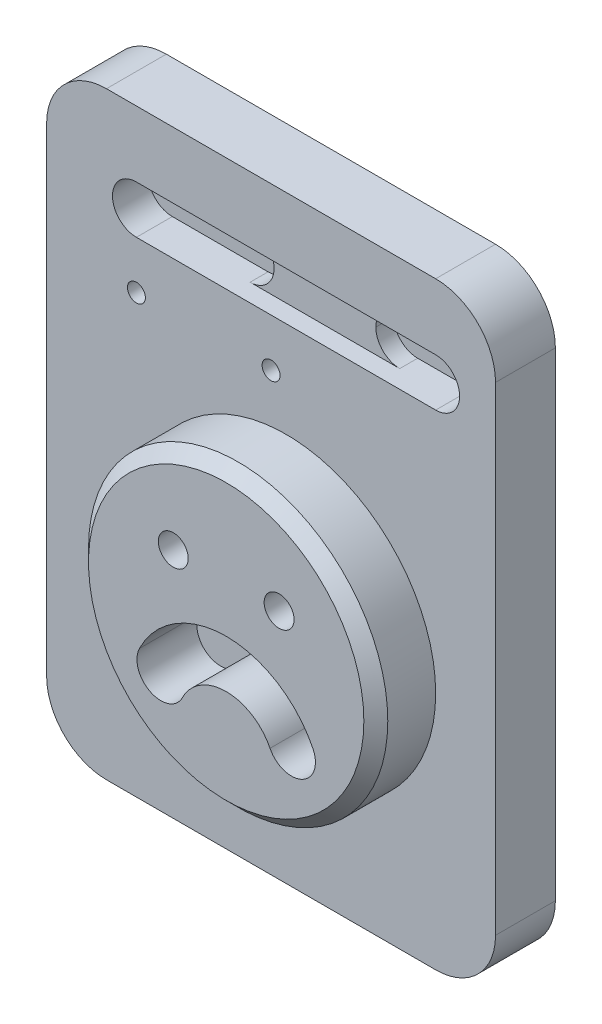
ISO-10303-21;
HEADER;
FILE_DESCRIPTION(('STEP AP214'),'2;1');
FILE_NAME('part.step','',(''),(''),'','','');
FILE_SCHEMA(('AUTOMOTIVE_DESIGN { 1 0 10303 214 1 1 1 1 }'));
ENDSEC;
DATA;
#1=APPLICATION_CONTEXT('core data for automotive mechanical design processes');
#2=APPLICATION_PROTOCOL_DEFINITION('international standard','automotive_design',2000,#1);
#3=PRODUCT_CONTEXT('',#1,'mechanical');
#4=PRODUCT('Part','Part','',(#3));
#5=PRODUCT_RELATED_PRODUCT_CATEGORY('part','',(#4));
#6=PRODUCT_DEFINITION_FORMATION('','',#4);
#7=PRODUCT_DEFINITION_CONTEXT('part definition',#1,'design');
#8=PRODUCT_DEFINITION('design','',#6,#7);
#9=PRODUCT_DEFINITION_SHAPE('','',#8);
#10=(LENGTH_UNIT() NAMED_UNIT(*) SI_UNIT(.MILLI.,.METRE.));
#11=(NAMED_UNIT(*) PLANE_ANGLE_UNIT() SI_UNIT($,.RADIAN.));
#12=(NAMED_UNIT(*) SI_UNIT($,.STERADIAN.) SOLID_ANGLE_UNIT());
#13=UNCERTAINTY_MEASURE_WITH_UNIT(LENGTH_MEASURE(1.E-05),#10,'distance_accuracy_value','');
#14=(GEOMETRIC_REPRESENTATION_CONTEXT(3) GLOBAL_UNCERTAINTY_ASSIGNED_CONTEXT((#13)) GLOBAL_UNIT_ASSIGNED_CONTEXT((#10,
#11,#12)) REPRESENTATION_CONTEXT('',''));
#15=CARTESIAN_POINT('',(0.,0.,0.));
#16=DIRECTION('',(0.,0.,1.));
#17=DIRECTION('',(1.,0.,0.));
#18=AXIS2_PLACEMENT_3D('',#15,#16,#17);
#19=CARTESIAN_POINT('',(15.,89.,4.));
#20=DIRECTION('',(0.,1.,0.));
#21=DIRECTION('',(-1.,0.,0.));
#22=AXIS2_PLACEMENT_3D('',#19,#20,#21);
#23=PLANE('',#22);
#24=DIRECTION('',(-1.,0.,0.));
#25=VECTOR('',#24,1.);
#26=CARTESIAN_POINT('',(35.,89.,7.));
#27=LINE('',#26,#25);
#28=CARTESIAN_POINT('',(56.,89.,7.));
#29=VERTEX_POINT('',#28);
#30=CARTESIAN_POINT('',(31.,89.,7.));
#31=VERTEX_POINT('',#30);
#32=EDGE_CURVE('E247',#29,#31,#27,.T.);
#33=ORIENTED_EDGE('',*,*,#32,.F.);
#34=DIRECTION('',(0.,0.,-1.));
#35=VECTOR('',#34,1.);
#36=CARTESIAN_POINT('',(56.,89.,4.));
#37=LINE('',#36,#35);
#38=CARTESIAN_POINT('',(56.,89.,4.));
#39=VERTEX_POINT('',#38);
#40=EDGE_CURVE('E435',#29,#39,#37,.T.);
#41=ORIENTED_EDGE('',*,*,#40,.T.);
#42=DIRECTION('',(-1.,0.,0.));
#43=VECTOR('',#42,1.);
#44=CARTESIAN_POINT('',(15.,89.,4.));
#45=LINE('',#44,#43);
#46=CARTESIAN_POINT('',(65.,89.,4.));
#47=VERTEX_POINT('',#46);
#48=EDGE_CURVE('E283',#47,#39,#45,.T.);
#49=ORIENTED_EDGE('',*,*,#48,.F.);
#50=DIRECTION('',(0.,0.,1.));
#51=VECTOR('',#50,1.);
#52=CARTESIAN_POINT('',(65.,89.,4.));
#53=LINE('',#52,#51);
#54=CARTESIAN_POINT('',(65.,89.,10.));
#55=VERTEX_POINT('',#54);
#56=EDGE_CURVE('E305',#47,#55,#53,.T.);
#57=ORIENTED_EDGE('',*,*,#56,.T.);
#58=DIRECTION('',(-1.,0.,0.));
#59=VECTOR('',#58,1.);
#60=CARTESIAN_POINT('',(15.,89.,10.));
#61=LINE('',#60,#59);
#62=CARTESIAN_POINT('',(15.,89.,10.));
#63=VERTEX_POINT('',#62);
#64=EDGE_CURVE('E273',#55,#63,#61,.T.);
#65=ORIENTED_EDGE('',*,*,#64,.T.);
#66=DIRECTION('',(0.,0.,1.));
#67=VECTOR('',#66,1.);
#68=CARTESIAN_POINT('',(15.,89.,4.));
#69=LINE('',#68,#67);
#70=CARTESIAN_POINT('',(15.,89.,4.));
#71=VERTEX_POINT('',#70);
#72=EDGE_CURVE('E301',#71,#63,#69,.T.);
#73=ORIENTED_EDGE('',*,*,#72,.F.);
#74=CARTESIAN_POINT('',(31.,89.,4.));
#75=VERTEX_POINT('',#74);
#76=EDGE_CURVE('E282',#75,#71,#45,.T.);
#77=ORIENTED_EDGE('',*,*,#76,.F.);
#78=DIRECTION('',(0.,0.,-1.));
#79=VECTOR('',#78,1.);
#80=CARTESIAN_POINT('',(31.,89.,7.));
#81=LINE('',#80,#79);
#82=EDGE_CURVE('E431',#75,#31,#81,.F.);
#83=ORIENTED_EDGE('',*,*,#82,.T.);
#84=EDGE_LOOP('',(#33,#41,#49,#57,#65,#73,#77,#83));
#85=FACE_BOUND('',#84,.T.);
#86=ADVANCED_FACE('F41',(#85),#23,.F.);
#87=CARTESIAN_POINT('',(15.,81.,4.));
#88=DIRECTION('',(0.,-1.,0.));
#89=DIRECTION('',(0.,0.,-1.));
#90=AXIS2_PLACEMENT_3D('',#87,#88,#89);
#91=PLANE('',#90);
#92=DIRECTION('',(1.,0.,0.));
#93=VECTOR('',#92,1.);
#94=CARTESIAN_POINT('',(15.,81.,4.));
#95=LINE('',#94,#93);
#96=CARTESIAN_POINT('',(56.,81.,4.));
#97=VERTEX_POINT('',#96);
#98=CARTESIAN_POINT('',(65.,81.,4.));
#99=VERTEX_POINT('',#98);
#100=EDGE_CURVE('E272',#97,#99,#95,.T.);
#101=ORIENTED_EDGE('',*,*,#100,.F.);
#102=DIRECTION('',(0.,0.,-1.));
#103=VECTOR('',#102,1.);
#104=CARTESIAN_POINT('',(56.,81.,7.));
#105=LINE('',#104,#103);
#106=CARTESIAN_POINT('',(56.,81.,7.));
#107=VERTEX_POINT('',#106);
#108=EDGE_CURVE('E427',#97,#107,#105,.F.);
#109=ORIENTED_EDGE('',*,*,#108,.T.);
#110=DIRECTION('',(1.,0.,0.));
#111=VECTOR('',#110,1.);
#112=CARTESIAN_POINT('',(35.,81.,7.));
#113=LINE('',#112,#111);
#114=CARTESIAN_POINT('',(31.,81.,7.));
#115=VERTEX_POINT('',#114);
#116=EDGE_CURVE('E244',#115,#107,#113,.T.);
#117=ORIENTED_EDGE('',*,*,#116,.F.);
#118=DIRECTION('',(0.,0.,-1.));
#119=VECTOR('',#118,1.);
#120=CARTESIAN_POINT('',(31.,81.,4.));
#121=LINE('',#120,#119);
#122=CARTESIAN_POINT('',(31.,81.,4.));
#123=VERTEX_POINT('',#122);
#124=EDGE_CURVE('E423',#115,#123,#121,.T.);
#125=ORIENTED_EDGE('',*,*,#124,.T.);
#126=CARTESIAN_POINT('',(15.,81.,4.));
#127=VERTEX_POINT('',#126);
#128=EDGE_CURVE('E274',#127,#123,#95,.T.);
#129=ORIENTED_EDGE('',*,*,#128,.F.);
#130=DIRECTION('',(0.,0.,1.));
#131=VECTOR('',#130,1.);
#132=CARTESIAN_POINT('',(15.,81.,4.));
#133=LINE('',#132,#131);
#134=CARTESIAN_POINT('',(15.,81.,10.));
#135=VERTEX_POINT('',#134);
#136=EDGE_CURVE('E287',#127,#135,#133,.T.);
#137=ORIENTED_EDGE('',*,*,#136,.T.);
#138=DIRECTION('',(1.,0.,0.));
#139=VECTOR('',#138,1.);
#140=CARTESIAN_POINT('',(15.,81.,10.));
#141=LINE('',#140,#139);
#142=CARTESIAN_POINT('',(65.,81.,10.));
#143=VERTEX_POINT('',#142);
#144=EDGE_CURVE('E290',#135,#143,#141,.T.);
#145=ORIENTED_EDGE('',*,*,#144,.T.);
#146=DIRECTION('',(0.,0.,1.));
#147=VECTOR('',#146,1.);
#148=CARTESIAN_POINT('',(65.,81.,4.));
#149=LINE('',#148,#147);
#150=EDGE_CURVE('E308',#99,#143,#149,.T.);
#151=ORIENTED_EDGE('',*,*,#150,.F.);
#152=EDGE_LOOP('',(#101,#109,#117,#125,#129,#137,#145,#151));
#153=FACE_BOUND('',#152,.T.);
#154=ADVANCED_FACE('F476',(#153),#91,.F.);
#155=CARTESIAN_POINT('',(15.,85.,4.));
#156=DIRECTION('',(0.,0.,1.));
#157=DIRECTION('',(1.,0.,0.));
#158=AXIS2_PLACEMENT_3D('',#155,#156,#157);
#159=PLANE('',#158);
#160=ORIENTED_EDGE('',*,*,#128,.T.);
#161=CARTESIAN_POINT('',(31.,85.,4.));
#162=DIRECTION('',(0.,0.,1.));
#163=DIRECTION('',(1.,0.,0.));
#164=AXIS2_PLACEMENT_3D('',#161,#162,#163);
#165=CIRCLE('',#164,4.);
#166=CARTESIAN_POINT('',(35.,85.,4.));
#167=VERTEX_POINT('',#166);
#168=EDGE_CURVE('E441',#123,#167,#165,.T.);
#169=ORIENTED_EDGE('',*,*,#168,.T.);
#170=CARTESIAN_POINT('',(31.,85.,4.));
#171=DIRECTION('',(0.,0.,1.));
#172=DIRECTION('',(1.,0.,0.));
#173=AXIS2_PLACEMENT_3D('',#170,#171,#172);
#174=CIRCLE('',#173,4.);
#175=EDGE_CURVE('E438',#167,#75,#174,.T.);
#176=ORIENTED_EDGE('',*,*,#175,.T.);
#177=ORIENTED_EDGE('',*,*,#76,.T.);
#178=CARTESIAN_POINT('',(15.,85.,4.));
#179=DIRECTION('',(0.,0.,1.));
#180=DIRECTION('',(1.,0.,0.));
#181=AXIS2_PLACEMENT_3D('',#178,#179,#180);
#182=CIRCLE('',#181,3.99999999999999);
#183=EDGE_CURVE('E268',#71,#127,#182,.T.);
#184=ORIENTED_EDGE('',*,*,#183,.T.);
#185=EDGE_LOOP('',(#160,#169,#176,#177,#184));
#186=FACE_BOUND('',#185,.T.);
#187=ADVANCED_FACE('F482',(#186),#159,.T.);
#188=CARTESIAN_POINT('',(56.,85.,4.));
#189=DIRECTION('',(0.,0.,1.));
#190=DIRECTION('',(1.,0.,0.));
#191=AXIS2_PLACEMENT_3D('',#188,#189,#190);
#192=CIRCLE('',#191,4.);
#193=CARTESIAN_POINT('',(52.,85.,4.));
#194=VERTEX_POINT('',#193);
#195=EDGE_CURVE('E417',#39,#194,#192,.T.);
#196=ORIENTED_EDGE('',*,*,#195,.T.);
#197=CARTESIAN_POINT('',(56.,85.,4.));
#198=DIRECTION('',(0.,0.,1.));
#199=DIRECTION('',(1.,0.,0.));
#200=AXIS2_PLACEMENT_3D('',#197,#198,#199);
#201=CIRCLE('',#200,4.);
#202=EDGE_CURVE('E420',#194,#97,#201,.T.);
#203=ORIENTED_EDGE('',*,*,#202,.T.);
#204=ORIENTED_EDGE('',*,*,#100,.T.);
#205=CARTESIAN_POINT('',(65.,85.,4.));
#206=DIRECTION('',(0.,0.,1.));
#207=DIRECTION('',(1.,0.,0.));
#208=AXIS2_PLACEMENT_3D('',#205,#206,#207);
#209=CIRCLE('',#208,4.);
#210=EDGE_CURVE('E278',#99,#47,#209,.T.);
#211=ORIENTED_EDGE('',*,*,#210,.T.);
#212=ORIENTED_EDGE('',*,*,#48,.T.);
#213=EDGE_LOOP('',(#196,#203,#204,#211,#212));
#214=FACE_BOUND('',#213,.T.);
#215=ADVANCED_FACE('F534',(#214),#159,.T.);
#216=CARTESIAN_POINT('',(0.,0.,10.));
#217=DIRECTION('',(1.,0.,0.));
#218=DIRECTION('',(0.,0.,-1.));
#219=AXIS2_PLACEMENT_3D('',#216,#217,#218);
#220=PLANE('',#219);
#221=DIRECTION('',(0.,-1.,0.));
#222=VECTOR('',#221,1.);
#223=CARTESIAN_POINT('',(0.,0.,0.));
#224=LINE('',#223,#222);
#225=CARTESIAN_POINT('',(0.,90.,0.));
#226=VERTEX_POINT('',#225);
#227=CARTESIAN_POINT('',(0.,10.,0.));
#228=VERTEX_POINT('',#227);
#229=EDGE_CURVE('E329',#226,#228,#224,.T.);
#230=ORIENTED_EDGE('',*,*,#229,.T.);
#231=DIRECTION('',(0.,0.,-1.));
#232=VECTOR('',#231,1.);
#233=CARTESIAN_POINT('',(0.,10.,10.));
#234=LINE('',#233,#232);
#235=CARTESIAN_POINT('',(0.,10.,10.));
#236=VERTEX_POINT('',#235);
#237=EDGE_CURVE('E388',#228,#236,#234,.F.);
#238=ORIENTED_EDGE('',*,*,#237,.T.);
#239=DIRECTION('',(0.,-1.,0.));
#240=VECTOR('',#239,1.);
#241=CARTESIAN_POINT('',(0.,0.,10.));
#242=LINE('',#241,#240);
#243=CARTESIAN_POINT('',(0.,90.,10.));
#244=VERTEX_POINT('',#243);
#245=EDGE_CURVE('E336',#244,#236,#242,.T.);
#246=ORIENTED_EDGE('',*,*,#245,.F.);
#247=DIRECTION('',(0.,0.,-1.));
#248=VECTOR('',#247,1.);
#249=CARTESIAN_POINT('',(0.,90.,10.));
#250=LINE('',#249,#248);
#251=EDGE_CURVE('E384',#244,#226,#250,.T.);
#252=ORIENTED_EDGE('',*,*,#251,.T.);
#253=EDGE_LOOP('',(#230,#238,#246,#252));
#254=FACE_BOUND('',#253,.T.);
#255=ADVANCED_FACE('F530',(#254),#220,.F.);
#256=CARTESIAN_POINT('',(0.,0.,10.));
#257=DIRECTION('',(0.,1.,0.));
#258=DIRECTION('',(0.,0.,1.));
#259=AXIS2_PLACEMENT_3D('',#256,#257,#258);
#260=PLANE('',#259);
#261=DIRECTION('',(1.,0.,0.));
#262=VECTOR('',#261,1.);
#263=CARTESIAN_POINT('',(0.,0.,10.));
#264=LINE('',#263,#262);
#265=CARTESIAN_POINT('',(10.,0.,10.));
#266=VERTEX_POINT('',#265);
#267=CARTESIAN_POINT('',(65.,0.,10.));
#268=VERTEX_POINT('',#267);
#269=EDGE_CURVE('E340',#266,#268,#264,.T.);
#270=ORIENTED_EDGE('',*,*,#269,.F.);
#271=DIRECTION('',(0.,0.,-1.));
#272=VECTOR('',#271,1.);
#273=CARTESIAN_POINT('',(10.,0.,10.));
#274=LINE('',#273,#272);
#275=CARTESIAN_POINT('',(10.,0.,0.));
#276=VERTEX_POINT('',#275);
#277=EDGE_CURVE('E368',#266,#276,#274,.T.);
#278=ORIENTED_EDGE('',*,*,#277,.T.);
#279=DIRECTION('',(1.,0.,0.));
#280=VECTOR('',#279,1.);
#281=CARTESIAN_POINT('',(0.,0.,0.));
#282=LINE('',#281,#280);
#283=CARTESIAN_POINT('',(65.,0.,0.));
#284=VERTEX_POINT('',#283);
#285=EDGE_CURVE('E355',#276,#284,#282,.T.);
#286=ORIENTED_EDGE('',*,*,#285,.T.);
#287=DIRECTION('',(0.,0.,-1.));
#288=VECTOR('',#287,1.);
#289=CARTESIAN_POINT('',(65.,0.,10.));
#290=LINE('',#289,#288);
#291=EDGE_CURVE('E334',#284,#268,#290,.F.);
#292=ORIENTED_EDGE('',*,*,#291,.T.);
#293=EDGE_LOOP('',(#270,#278,#286,#292));
#294=FACE_BOUND('',#293,.T.);
#295=ADVANCED_FACE('F526',(#294),#260,.F.);
#296=CARTESIAN_POINT('',(75.,0.,10.));
#297=DIRECTION('',(-1.,0.,0.));
#298=DIRECTION('',(0.,0.,1.));
#299=AXIS2_PLACEMENT_3D('',#296,#297,#298);
#300=PLANE('',#299);
#301=DIRECTION('',(0.,1.,0.));
#302=VECTOR('',#301,1.);
#303=CARTESIAN_POINT('',(75.,0.,10.));
#304=LINE('',#303,#302);
#305=CARTESIAN_POINT('',(75.,10.,10.));
#306=VERTEX_POINT('',#305);
#307=CARTESIAN_POINT('',(75.,90.,10.));
#308=VERTEX_POINT('',#307);
#309=EDGE_CURVE('E345',#306,#308,#304,.T.);
#310=ORIENTED_EDGE('',*,*,#309,.F.);
#311=DIRECTION('',(0.,0.,-1.));
#312=VECTOR('',#311,1.);
#313=CARTESIAN_POINT('',(75.,10.,10.));
#314=LINE('',#313,#312);
#315=CARTESIAN_POINT('',(75.,10.,0.));
#316=VERTEX_POINT('',#315);
#317=EDGE_CURVE('E406',#306,#316,#314,.T.);
#318=ORIENTED_EDGE('',*,*,#317,.T.);
#319=DIRECTION('',(0.,1.,0.));
#320=VECTOR('',#319,1.);
#321=CARTESIAN_POINT('',(75.,0.,0.));
#322=LINE('',#321,#320);
#323=CARTESIAN_POINT('',(75.,90.,0.));
#324=VERTEX_POINT('',#323);
#325=EDGE_CURVE('E359',#316,#324,#322,.T.);
#326=ORIENTED_EDGE('',*,*,#325,.T.);
#327=DIRECTION('',(0.,0.,-1.));
#328=VECTOR('',#327,1.);
#329=CARTESIAN_POINT('',(75.,90.,10.));
#330=LINE('',#329,#328);
#331=EDGE_CURVE('E403',#324,#308,#330,.F.);
#332=ORIENTED_EDGE('',*,*,#331,.T.);
#333=EDGE_LOOP('',(#310,#318,#326,#332));
#334=FACE_BOUND('',#333,.T.);
#335=ADVANCED_FACE('F522',(#334),#300,.F.);
#336=CARTESIAN_POINT('',(0.,100.,10.));
#337=DIRECTION('',(0.,-1.,0.));
#338=DIRECTION('',(0.,0.,-1.));
#339=AXIS2_PLACEMENT_3D('',#336,#337,#338);
#340=PLANE('',#339);
#341=DIRECTION('',(-1.,0.,0.));
#342=VECTOR('',#341,1.);
#343=CARTESIAN_POINT('',(0.,100.,10.));
#344=LINE('',#343,#342);
#345=CARTESIAN_POINT('',(65.,100.,10.));
#346=VERTEX_POINT('',#345);
#347=CARTESIAN_POINT('',(10.,100.,10.));
#348=VERTEX_POINT('',#347);
#349=EDGE_CURVE('E335',#346,#348,#344,.T.);
#350=ORIENTED_EDGE('',*,*,#349,.F.);
#351=DIRECTION('',(0.,0.,-1.));
#352=VECTOR('',#351,1.);
#353=CARTESIAN_POINT('',(65.,100.,10.));
#354=LINE('',#353,#352);
#355=CARTESIAN_POINT('',(65.,100.,0.));
#356=VERTEX_POINT('',#355);
#357=EDGE_CURVE('E413',#346,#356,#354,.T.);
#358=ORIENTED_EDGE('',*,*,#357,.T.);
#359=DIRECTION('',(-1.,0.,0.));
#360=VECTOR('',#359,1.);
#361=CARTESIAN_POINT('',(0.,100.,0.));
#362=LINE('',#361,#360);
#363=CARTESIAN_POINT('',(10.,100.,0.));
#364=VERTEX_POINT('',#363);
#365=EDGE_CURVE('E341',#356,#364,#362,.T.);
#366=ORIENTED_EDGE('',*,*,#365,.T.);
#367=DIRECTION('',(0.,0.,-1.));
#368=VECTOR('',#367,1.);
#369=CARTESIAN_POINT('',(10.,100.,10.));
#370=LINE('',#369,#368);
#371=EDGE_CURVE('E410',#364,#348,#370,.F.);
#372=ORIENTED_EDGE('',*,*,#371,.T.);
#373=EDGE_LOOP('',(#350,#358,#366,#372));
#374=FACE_BOUND('',#373,.T.);
#375=ADVANCED_FACE('F515',(#374),#340,.F.);
#376=CARTESIAN_POINT('',(0.,0.,10.));
#377=DIRECTION('',(0.,0.,-1.));
#378=DIRECTION('',(-1.,0.,0.));
#379=AXIS2_PLACEMENT_3D('',#376,#377,#378);
#380=PLANE('',#379);
#381=CARTESIAN_POINT('',(15.,73.,10.));
#382=DIRECTION('',(0.,0.,1.));
#383=DIRECTION('',(1.,0.,0.));
#384=AXIS2_PLACEMENT_3D('',#381,#382,#383);
#385=CIRCLE('',#384,1.5);
#386=CARTESIAN_POINT('',(16.5,73.,10.));
#387=VERTEX_POINT('',#386);
#388=EDGE_CURVE('E251',#387,#387,#385,.T.);
#389=ORIENTED_EDGE('',*,*,#388,.F.);
#390=EDGE_LOOP('',(#389));
#391=FACE_BOUND('',#390,.T.);
#392=CARTESIAN_POINT('',(37.5,73.,10.));
#393=DIRECTION('',(0.,0.,1.));
#394=DIRECTION('',(1.,0.,0.));
#395=AXIS2_PLACEMENT_3D('',#392,#393,#394);
#396=CIRCLE('',#395,1.5);
#397=CARTESIAN_POINT('',(39.,73.,10.));
#398=VERTEX_POINT('',#397);
#399=EDGE_CURVE('E259',#398,#398,#396,.T.);
#400=ORIENTED_EDGE('',*,*,#399,.F.);
#401=EDGE_LOOP('',(#400));
#402=FACE_BOUND('',#401,.T.);
#403=ORIENTED_EDGE('',*,*,#144,.F.);
#404=CARTESIAN_POINT('',(15.,85.,10.));
#405=DIRECTION('',(0.,0.,1.));
#406=DIRECTION('',(1.,0.,0.));
#407=AXIS2_PLACEMENT_3D('',#404,#405,#406);
#408=CIRCLE('',#407,3.99999999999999);
#409=EDGE_CURVE('E267',#63,#135,#408,.T.);
#410=ORIENTED_EDGE('',*,*,#409,.F.);
#411=ORIENTED_EDGE('',*,*,#64,.F.);
#412=CARTESIAN_POINT('',(65.,85.,10.));
#413=DIRECTION('',(0.,0.,1.));
#414=DIRECTION('',(1.,0.,0.));
#415=AXIS2_PLACEMENT_3D('',#412,#413,#414);
#416=CIRCLE('',#415,4.);
#417=EDGE_CURVE('E294',#143,#55,#416,.T.);
#418=ORIENTED_EDGE('',*,*,#417,.F.);
#419=EDGE_LOOP('',(#403,#410,#411,#418));
#420=FACE_BOUND('',#419,.T.);
#421=CARTESIAN_POINT('',(40.,40.,10.));
#422=DIRECTION('',(0.,0.,1.));
#423=DIRECTION('',(1.,0.,0.));
#424=AXIS2_PLACEMENT_3D('',#421,#422,#423);
#425=CIRCLE('',#424,25.);
#426=CARTESIAN_POINT('',(65.,40.,10.));
#427=VERTEX_POINT('',#426);
#428=EDGE_CURVE('E330',#427,#427,#425,.T.);
#429=ORIENTED_EDGE('',*,*,#428,.F.);
#430=EDGE_LOOP('',(#429));
#431=FACE_BOUND('',#430,.T.);
#432=ORIENTED_EDGE('',*,*,#245,.T.);
#433=CARTESIAN_POINT('',(10.,10.,10.));
#434=DIRECTION('',(0.,0.,-1.));
#435=DIRECTION('',(-1.,0.,0.));
#436=AXIS2_PLACEMENT_3D('',#433,#434,#435);
#437=CIRCLE('',#436,10.);
#438=EDGE_CURVE('E400',#236,#266,#437,.F.);
#439=ORIENTED_EDGE('',*,*,#438,.T.);
#440=ORIENTED_EDGE('',*,*,#269,.T.);
#441=CARTESIAN_POINT('',(65.,10.,10.));
#442=DIRECTION('',(0.,0.,-1.));
#443=DIRECTION('',(-1.,0.,0.));
#444=AXIS2_PLACEMENT_3D('',#441,#442,#443);
#445=CIRCLE('',#444,10.);
#446=EDGE_CURVE('E397',#268,#306,#445,.F.);
#447=ORIENTED_EDGE('',*,*,#446,.T.);
#448=ORIENTED_EDGE('',*,*,#309,.T.);
#449=CARTESIAN_POINT('',(65.,90.,10.));
#450=DIRECTION('',(0.,0.,-1.));
#451=DIRECTION('',(-1.,0.,0.));
#452=AXIS2_PLACEMENT_3D('',#449,#450,#451);
#453=CIRCLE('',#452,10.);
#454=EDGE_CURVE('E394',#308,#346,#453,.F.);
#455=ORIENTED_EDGE('',*,*,#454,.T.);
#456=ORIENTED_EDGE('',*,*,#349,.T.);
#457=CARTESIAN_POINT('',(10.,90.,10.));
#458=DIRECTION('',(0.,0.,-1.));
#459=DIRECTION('',(-1.,0.,0.));
#460=AXIS2_PLACEMENT_3D('',#457,#458,#459);
#461=CIRCLE('',#460,10.);
#462=EDGE_CURVE('E391',#348,#244,#461,.F.);
#463=ORIENTED_EDGE('',*,*,#462,.T.);
#464=EDGE_LOOP('',(#432,#439,#440,#447,#448,#455,#456,#463));
#465=FACE_BOUND('',#464,.T.);
#466=ADVANCED_FACE('F512',(#391,#402,#420,#431,#465),#380,.F.);
#467=CARTESIAN_POINT('',(0.,0.,0.));
#468=DIRECTION('',(0.,0.,-1.));
#469=DIRECTION('',(-1.,0.,0.));
#470=AXIS2_PLACEMENT_3D('',#467,#468,#469);
#471=PLANE('',#470);
#472=CARTESIAN_POINT('',(15.,73.,0.));
#473=DIRECTION('',(0.,0.,1.));
#474=DIRECTION('',(1.,0.,0.));
#475=AXIS2_PLACEMENT_3D('',#472,#473,#474);
#476=CIRCLE('',#475,1.5);
#477=CARTESIAN_POINT('',(16.5,73.,0.));
#478=VERTEX_POINT('',#477);
#479=EDGE_CURVE('E255',#478,#478,#476,.T.);
#480=ORIENTED_EDGE('',*,*,#479,.T.);
#481=EDGE_LOOP('',(#480));
#482=FACE_BOUND('',#481,.T.);
#483=CARTESIAN_POINT('',(37.5,73.,0.));
#484=DIRECTION('',(0.,0.,1.));
#485=DIRECTION('',(1.,0.,0.));
#486=AXIS2_PLACEMENT_3D('',#483,#484,#485);
#487=CIRCLE('',#486,1.49999999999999);
#488=CARTESIAN_POINT('',(39.,73.,0.));
#489=VERTEX_POINT('',#488);
#490=EDGE_CURVE('E263',#489,#489,#487,.T.);
#491=ORIENTED_EDGE('',*,*,#490,.T.);
#492=EDGE_LOOP('',(#491));
#493=FACE_BOUND('',#492,.T.);
#494=CARTESIAN_POINT('',(31.1611652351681,48.8388347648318,0.));
#495=DIRECTION('',(0.,0.,1.));
#496=DIRECTION('',(1.,0.,0.));
#497=AXIS2_PLACEMENT_3D('',#494,#495,#496);
#498=CIRCLE('',#497,2.5);
#499=CARTESIAN_POINT('',(33.6611652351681,48.8388347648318,0.));
#500=VERTEX_POINT('',#499);
#501=EDGE_CURVE('E317',#500,#500,#498,.T.);
#502=ORIENTED_EDGE('',*,*,#501,.T.);
#503=EDGE_LOOP('',(#502));
#504=FACE_BOUND('',#503,.T.);
#505=CARTESIAN_POINT('',(48.8388347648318,48.8388347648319,0.));
#506=DIRECTION('',(0.,0.,1.));
#507=DIRECTION('',(1.,0.,0.));
#508=AXIS2_PLACEMENT_3D('',#505,#506,#507);
#509=CIRCLE('',#508,2.5);
#510=CARTESIAN_POINT('',(51.3388347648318,48.8388347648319,0.));
#511=VERTEX_POINT('',#510);
#512=EDGE_CURVE('E325',#511,#511,#509,.T.);
#513=ORIENTED_EDGE('',*,*,#512,.T.);
#514=EDGE_LOOP('',(#513));
#515=FACE_BOUND('',#514,.T.);
#516=ORIENTED_EDGE('',*,*,#285,.F.);
#517=CARTESIAN_POINT('',(10.,10.,0.));
#518=DIRECTION('',(0.,0.,-1.));
#519=DIRECTION('',(-1.,0.,0.));
#520=AXIS2_PLACEMENT_3D('',#517,#518,#519);
#521=CIRCLE('',#520,10.);
#522=EDGE_CURVE('E381',#276,#228,#521,.T.);
#523=ORIENTED_EDGE('',*,*,#522,.T.);
#524=ORIENTED_EDGE('',*,*,#229,.F.);
#525=CARTESIAN_POINT('',(10.,90.,0.));
#526=DIRECTION('',(0.,0.,-1.));
#527=DIRECTION('',(-1.,0.,0.));
#528=AXIS2_PLACEMENT_3D('',#525,#526,#527);
#529=CIRCLE('',#528,10.);
#530=EDGE_CURVE('E372',#226,#364,#529,.T.);
#531=ORIENTED_EDGE('',*,*,#530,.T.);
#532=ORIENTED_EDGE('',*,*,#365,.F.);
#533=CARTESIAN_POINT('',(65.,90.,0.));
#534=DIRECTION('',(0.,0.,-1.));
#535=DIRECTION('',(-1.,0.,0.));
#536=AXIS2_PLACEMENT_3D('',#533,#534,#535);
#537=CIRCLE('',#536,10.);
#538=EDGE_CURVE('E375',#356,#324,#537,.T.);
#539=ORIENTED_EDGE('',*,*,#538,.T.);
#540=ORIENTED_EDGE('',*,*,#325,.F.);
#541=CARTESIAN_POINT('',(65.,10.,0.));
#542=DIRECTION('',(0.,0.,-1.));
#543=DIRECTION('',(-1.,0.,0.));
#544=AXIS2_PLACEMENT_3D('',#541,#542,#543);
#545=CIRCLE('',#544,10.);
#546=EDGE_CURVE('E378',#316,#284,#545,.T.);
#547=ORIENTED_EDGE('',*,*,#546,.T.);
#548=EDGE_LOOP('',(#516,#523,#524,#531,#532,#539,#540,#547));
#549=FACE_BOUND('',#548,.T.);
#550=ADVANCED_FACE('F510',(#482,#493,#504,#515,#549),#471,.T.);
#551=CARTESIAN_POINT('',(40.,40.,20.));
#552=DIRECTION('',(0.,0.,-1.));
#553=DIRECTION('',(-1.,0.,0.));
#554=AXIS2_PLACEMENT_3D('',#551,#552,#553);
#555=CYLINDRICAL_SURFACE('',#554,25.);
#556=CARTESIAN_POINT('',(40.,40.,18.));
#557=DIRECTION('',(0.,0.,1.));
#558=DIRECTION('',(1.,0.,0.));
#559=AXIS2_PLACEMENT_3D('',#556,#557,#558);
#560=CIRCLE('',#559,25.);
#561=CARTESIAN_POINT('',(65.,40.,18.));
#562=VERTEX_POINT('',#561);
#563=EDGE_CURVE('E11',#562,#562,#560,.F.);
#564=ORIENTED_EDGE('',*,*,#563,.T.);
#565=EDGE_LOOP('',(#564));
#566=FACE_BOUND('',#565,.T.);
#567=ORIENTED_EDGE('',*,*,#428,.T.);
#568=EDGE_LOOP('',(#567));
#569=FACE_BOUND('',#568,.T.);
#570=ADVANCED_FACE('F507',(#566,#569),#555,.T.);
#571=CARTESIAN_POINT('',(40.,40.,20.));
#572=DIRECTION('',(0.,0.,1.));
#573=DIRECTION('',(1.,0.,0.));
#574=AXIS2_PLACEMENT_3D('',#571,#572,#573);
#575=PLANE('',#574);
#576=CARTESIAN_POINT('',(40.,40.,20.));
#577=DIRECTION('',(0.,0.,1.));
#578=DIRECTION('',(1.,0.,0.));
#579=AXIS2_PLACEMENT_3D('',#576,#577,#578);
#580=CIRCLE('',#579,23.);
#581=CARTESIAN_POINT('',(63.,40.,20.));
#582=VERTEX_POINT('',#581);
#583=EDGE_CURVE('E51',#582,#582,#580,.T.);
#584=ORIENTED_EDGE('',*,*,#583,.T.);
#585=EDGE_LOOP('',(#584));
#586=FACE_BOUND('',#585,.T.);
#587=CARTESIAN_POINT('',(50.9109120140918,29.9880693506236,20.));
#588=DIRECTION('',(0.,0.,1.));
#589=DIRECTION('',(1.,0.,0.));
#590=AXIS2_PLACEMENT_3D('',#587,#588,#589);
#591=CIRCLE('',#590,3.99999999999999);
#592=CARTESIAN_POINT('',(47.3232005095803,28.2193618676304,20.));
#593=VERTEX_POINT('',#592);
#594=CARTESIAN_POINT('',(54.4986235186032,31.7567768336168,20.));
#595=VERTEX_POINT('',#594);
#596=EDGE_CURVE('E58',#593,#595,#591,.T.);
#597=ORIENTED_EDGE('',*,*,#596,.F.);
#598=CARTESIAN_POINT('',(40.,24.6090940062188,20.));
#599=DIRECTION('',(0.,0.,-1.));
#600=DIRECTION('',(1.,0.,0.));
#601=AXIS2_PLACEMENT_3D('',#598,#599,#600);
#602=CIRCLE('',#601,8.16475962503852);
#603=CARTESIAN_POINT('',(32.6767994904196,28.2193618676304,20.));
#604=VERTEX_POINT('',#603);
#605=EDGE_CURVE('E216',#604,#593,#602,.T.);
#606=ORIENTED_EDGE('',*,*,#605,.F.);
#607=CARTESIAN_POINT('',(29.0890879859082,29.9880693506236,20.));
#608=DIRECTION('',(0.,0.,1.));
#609=DIRECTION('',(1.,0.,0.));
#610=AXIS2_PLACEMENT_3D('',#607,#608,#609);
#611=CIRCLE('',#610,3.99999999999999);
#612=CARTESIAN_POINT('',(25.5013764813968,31.7567768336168,20.));
#613=VERTEX_POINT('',#612);
#614=EDGE_CURVE('E220',#613,#604,#611,.T.);
#615=ORIENTED_EDGE('',*,*,#614,.F.);
#616=CARTESIAN_POINT('',(40.,24.6090940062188,20.));
#617=DIRECTION('',(0.,0.,1.));
#618=DIRECTION('',(1.,0.,0.));
#619=AXIS2_PLACEMENT_3D('',#616,#617,#618);
#620=CIRCLE('',#619,16.1647596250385);
#621=EDGE_CURVE('E229',#595,#613,#620,.T.);
#622=ORIENTED_EDGE('',*,*,#621,.F.);
#623=EDGE_LOOP('',(#597,#606,#615,#622));
#624=FACE_BOUND('',#623,.T.);
#625=CARTESIAN_POINT('',(31.1611652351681,48.8388347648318,20.));
#626=DIRECTION('',(0.,0.,1.));
#627=DIRECTION('',(1.,0.,0.));
#628=AXIS2_PLACEMENT_3D('',#625,#626,#627);
#629=CIRCLE('',#628,2.5);
#630=CARTESIAN_POINT('',(33.6611652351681,48.8388347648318,20.));
#631=VERTEX_POINT('',#630);
#632=EDGE_CURVE('E304',#631,#631,#629,.T.);
#633=ORIENTED_EDGE('',*,*,#632,.F.);
#634=EDGE_LOOP('',(#633));
#635=FACE_BOUND('',#634,.T.);
#636=CARTESIAN_POINT('',(48.8388347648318,48.8388347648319,20.));
#637=DIRECTION('',(0.,0.,1.));
#638=DIRECTION('',(1.,0.,0.));
#639=AXIS2_PLACEMENT_3D('',#636,#637,#638);
#640=CIRCLE('',#639,2.5);
#641=CARTESIAN_POINT('',(51.3388347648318,48.8388347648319,20.));
#642=VERTEX_POINT('',#641);
#643=EDGE_CURVE('E321',#642,#642,#640,.T.);
#644=ORIENTED_EDGE('',*,*,#643,.F.);
#645=EDGE_LOOP('',(#644));
#646=FACE_BOUND('',#645,.T.);
#647=ADVANCED_FACE('F465',(#586,#624,#635,#646),#575,.T.);
#648=CARTESIAN_POINT('',(48.8388347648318,48.8388347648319,20.));
#649=DIRECTION('',(0.,0.,1.));
#650=DIRECTION('',(1.,0.,0.));
#651=AXIS2_PLACEMENT_3D('',#648,#649,#650);
#652=CYLINDRICAL_SURFACE('',#651,2.5);
#653=ORIENTED_EDGE('',*,*,#512,.F.);
#654=EDGE_LOOP('',(#653));
#655=FACE_BOUND('',#654,.T.);
#656=ORIENTED_EDGE('',*,*,#643,.T.);
#657=EDGE_LOOP('',(#656));
#658=FACE_BOUND('',#657,.T.);
#659=ADVANCED_FACE('F500',(#655,#658),#652,.F.);
#660=CARTESIAN_POINT('',(31.1611652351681,48.8388347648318,20.));
#661=DIRECTION('',(0.,0.,1.));
#662=DIRECTION('',(1.,0.,0.));
#663=AXIS2_PLACEMENT_3D('',#660,#661,#662);
#664=CYLINDRICAL_SURFACE('',#663,2.5);
#665=ORIENTED_EDGE('',*,*,#501,.F.);
#666=EDGE_LOOP('',(#665));
#667=FACE_BOUND('',#666,.T.);
#668=ORIENTED_EDGE('',*,*,#632,.T.);
#669=EDGE_LOOP('',(#668));
#670=FACE_BOUND('',#669,.T.);
#671=ADVANCED_FACE('F496',(#667,#670),#664,.F.);
#672=CARTESIAN_POINT('',(15.,85.,4.));
#673=DIRECTION('',(0.,0.,1.));
#674=DIRECTION('',(1.,0.,0.));
#675=AXIS2_PLACEMENT_3D('',#672,#673,#674);
#676=CYLINDRICAL_SURFACE('',#675,3.99999999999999);
#677=ORIENTED_EDGE('',*,*,#409,.T.);
#678=ORIENTED_EDGE('',*,*,#136,.F.);
#679=ORIENTED_EDGE('',*,*,#183,.F.);
#680=ORIENTED_EDGE('',*,*,#72,.T.);
#681=EDGE_LOOP('',(#677,#678,#679,#680));
#682=FACE_BOUND('',#681,.T.);
#683=ADVANCED_FACE('F491',(#682),#676,.F.);
#684=CARTESIAN_POINT('',(65.,85.,4.));
#685=DIRECTION('',(0.,0.,1.));
#686=DIRECTION('',(1.,0.,0.));
#687=AXIS2_PLACEMENT_3D('',#684,#685,#686);
#688=CYLINDRICAL_SURFACE('',#687,4.);
#689=ORIENTED_EDGE('',*,*,#417,.T.);
#690=ORIENTED_EDGE('',*,*,#56,.F.);
#691=ORIENTED_EDGE('',*,*,#210,.F.);
#692=ORIENTED_EDGE('',*,*,#150,.T.);
#693=EDGE_LOOP('',(#689,#690,#691,#692));
#694=FACE_BOUND('',#693,.T.);
#695=ADVANCED_FACE('F488',(#694),#688,.F.);
#696=CARTESIAN_POINT('',(10.,10.,10.));
#697=DIRECTION('',(0.,0.,-1.));
#698=DIRECTION('',(-1.,0.,0.));
#699=AXIS2_PLACEMENT_3D('',#696,#697,#698);
#700=CYLINDRICAL_SURFACE('',#699,10.);
#701=ORIENTED_EDGE('',*,*,#438,.F.);
#702=ORIENTED_EDGE('',*,*,#237,.F.);
#703=ORIENTED_EDGE('',*,*,#522,.F.);
#704=ORIENTED_EDGE('',*,*,#277,.F.);
#705=EDGE_LOOP('',(#701,#702,#703,#704));
#706=FACE_BOUND('',#705,.T.);
#707=ADVANCED_FACE('F490',(#706),#700,.T.);
#708=CARTESIAN_POINT('',(65.,10.,10.));
#709=DIRECTION('',(0.,0.,-1.));
#710=DIRECTION('',(-1.,0.,0.));
#711=AXIS2_PLACEMENT_3D('',#708,#709,#710);
#712=CYLINDRICAL_SURFACE('',#711,10.);
#713=ORIENTED_EDGE('',*,*,#446,.F.);
#714=ORIENTED_EDGE('',*,*,#291,.F.);
#715=ORIENTED_EDGE('',*,*,#546,.F.);
#716=ORIENTED_EDGE('',*,*,#317,.F.);
#717=EDGE_LOOP('',(#713,#714,#715,#716));
#718=FACE_BOUND('',#717,.T.);
#719=ADVANCED_FACE('F538',(#718),#712,.T.);
#720=CARTESIAN_POINT('',(65.,90.,10.));
#721=DIRECTION('',(0.,0.,-1.));
#722=DIRECTION('',(-1.,0.,0.));
#723=AXIS2_PLACEMENT_3D('',#720,#721,#722);
#724=CYLINDRICAL_SURFACE('',#723,10.);
#725=ORIENTED_EDGE('',*,*,#454,.F.);
#726=ORIENTED_EDGE('',*,*,#331,.F.);
#727=ORIENTED_EDGE('',*,*,#538,.F.);
#728=ORIENTED_EDGE('',*,*,#357,.F.);
#729=EDGE_LOOP('',(#725,#726,#727,#728));
#730=FACE_BOUND('',#729,.T.);
#731=ADVANCED_FACE('F542',(#730),#724,.T.);
#732=CARTESIAN_POINT('',(10.,90.,10.));
#733=DIRECTION('',(0.,0.,-1.));
#734=DIRECTION('',(-1.,0.,0.));
#735=AXIS2_PLACEMENT_3D('',#732,#733,#734);
#736=CYLINDRICAL_SURFACE('',#735,10.);
#737=ORIENTED_EDGE('',*,*,#462,.F.);
#738=ORIENTED_EDGE('',*,*,#371,.F.);
#739=ORIENTED_EDGE('',*,*,#530,.F.);
#740=ORIENTED_EDGE('',*,*,#251,.F.);
#741=EDGE_LOOP('',(#737,#738,#739,#740));
#742=FACE_BOUND('',#741,.T.);
#743=ADVANCED_FACE('F546',(#742),#736,.T.);
#744=CARTESIAN_POINT('',(37.5,73.,10.));
#745=DIRECTION('',(0.,0.,1.));
#746=DIRECTION('',(1.,0.,0.));
#747=AXIS2_PLACEMENT_3D('',#744,#745,#746);
#748=CYLINDRICAL_SURFACE('',#747,1.5);
#749=ORIENTED_EDGE('',*,*,#490,.F.);
#750=EDGE_LOOP('',(#749));
#751=FACE_BOUND('',#750,.T.);
#752=ORIENTED_EDGE('',*,*,#399,.T.);
#753=EDGE_LOOP('',(#752));
#754=FACE_BOUND('',#753,.T.);
#755=ADVANCED_FACE('F550',(#751,#754),#748,.F.);
#756=CARTESIAN_POINT('',(15.,73.,10.));
#757=DIRECTION('',(0.,0.,1.));
#758=DIRECTION('',(1.,0.,0.));
#759=AXIS2_PLACEMENT_3D('',#756,#757,#758);
#760=CYLINDRICAL_SURFACE('',#759,1.5);
#761=ORIENTED_EDGE('',*,*,#479,.F.);
#762=EDGE_LOOP('',(#761));
#763=FACE_BOUND('',#762,.T.);
#764=ORIENTED_EDGE('',*,*,#388,.T.);
#765=EDGE_LOOP('',(#764));
#766=FACE_BOUND('',#765,.T.);
#767=ADVANCED_FACE('F618',(#763,#766),#760,.F.);
#768=CARTESIAN_POINT('',(0.,0.,7.));
#769=DIRECTION('',(0.,0.,1.));
#770=DIRECTION('',(1.,0.,0.));
#771=AXIS2_PLACEMENT_3D('',#768,#769,#770);
#772=PLANE('',#771);
#773=ORIENTED_EDGE('',*,*,#32,.T.);
#774=CARTESIAN_POINT('',(31.,85.,7.));
#775=DIRECTION('',(0.,0.,1.));
#776=DIRECTION('',(1.,0.,0.));
#777=AXIS2_PLACEMENT_3D('',#774,#775,#776);
#778=CIRCLE('',#777,4.);
#779=CARTESIAN_POINT('',(35.,85.,7.));
#780=VERTEX_POINT('',#779);
#781=EDGE_CURVE('E66',#31,#780,#778,.F.);
#782=ORIENTED_EDGE('',*,*,#781,.T.);
#783=CARTESIAN_POINT('',(31.,85.,7.));
#784=DIRECTION('',(0.,0.,1.));
#785=DIRECTION('',(1.,0.,0.));
#786=AXIS2_PLACEMENT_3D('',#783,#784,#785);
#787=CIRCLE('',#786,4.);
#788=EDGE_CURVE('E451',#780,#115,#787,.F.);
#789=ORIENTED_EDGE('',*,*,#788,.T.);
#790=ORIENTED_EDGE('',*,*,#116,.T.);
#791=CARTESIAN_POINT('',(56.,85.,7.));
#792=DIRECTION('',(0.,0.,1.));
#793=DIRECTION('',(1.,0.,0.));
#794=AXIS2_PLACEMENT_3D('',#791,#792,#793);
#795=CIRCLE('',#794,4.);
#796=CARTESIAN_POINT('',(52.,85.,7.));
#797=VERTEX_POINT('',#796);
#798=EDGE_CURVE('E444',#107,#797,#795,.F.);
#799=ORIENTED_EDGE('',*,*,#798,.T.);
#800=CARTESIAN_POINT('',(56.,85.,7.));
#801=DIRECTION('',(0.,0.,1.));
#802=DIRECTION('',(1.,0.,0.));
#803=AXIS2_PLACEMENT_3D('',#800,#801,#802);
#804=CIRCLE('',#803,4.);
#805=EDGE_CURVE('E447',#797,#29,#804,.F.);
#806=ORIENTED_EDGE('',*,*,#805,.T.);
#807=EDGE_LOOP('',(#773,#782,#789,#790,#799,#806));
#808=FACE_BOUND('',#807,.T.);
#809=ADVANCED_FACE('F560',(#808),#772,.T.);
#810=CARTESIAN_POINT('',(56.,85.,4.));
#811=DIRECTION('',(0.,0.,1.));
#812=DIRECTION('',(1.,0.,0.));
#813=AXIS2_PLACEMENT_3D('',#810,#811,#812);
#814=CYLINDRICAL_SURFACE('',#813,4.);
#815=ORIENTED_EDGE('',*,*,#40,.F.);
#816=ORIENTED_EDGE('',*,*,#805,.F.);
#817=DIRECTION('',(0.,0.,-1.));
#818=VECTOR('',#817,1.);
#819=CARTESIAN_POINT('',(52.,85.,7.));
#820=LINE('',#819,#818);
#821=EDGE_CURVE('E248',#194,#797,#820,.F.);
#822=ORIENTED_EDGE('',*,*,#821,.F.);
#823=ORIENTED_EDGE('',*,*,#195,.F.);
#824=EDGE_LOOP('',(#815,#816,#822,#823));
#825=FACE_BOUND('',#824,.T.);
#826=ADVANCED_FACE('F556',(#825),#814,.F.);
#827=CARTESIAN_POINT('',(56.,85.,7.));
#828=DIRECTION('',(0.,0.,1.));
#829=DIRECTION('',(1.,0.,0.));
#830=AXIS2_PLACEMENT_3D('',#827,#828,#829);
#831=CYLINDRICAL_SURFACE('',#830,4.);
#832=ORIENTED_EDGE('',*,*,#798,.F.);
#833=ORIENTED_EDGE('',*,*,#108,.F.);
#834=ORIENTED_EDGE('',*,*,#202,.F.);
#835=ORIENTED_EDGE('',*,*,#821,.T.);
#836=EDGE_LOOP('',(#832,#833,#834,#835));
#837=FACE_BOUND('',#836,.T.);
#838=ADVANCED_FACE('F552',(#837),#831,.F.);
#839=CARTESIAN_POINT('',(31.,85.,7.));
#840=DIRECTION('',(0.,0.,1.));
#841=DIRECTION('',(1.,0.,0.));
#842=AXIS2_PLACEMENT_3D('',#839,#840,#841);
#843=CYLINDRICAL_SURFACE('',#842,4.);
#844=DIRECTION('',(0.,0.,-1.));
#845=VECTOR('',#844,1.);
#846=CARTESIAN_POINT('',(35.,85.,4.));
#847=LINE('',#846,#845);
#848=EDGE_CURVE('E238',#780,#167,#847,.T.);
#849=ORIENTED_EDGE('',*,*,#848,.F.);
#850=ORIENTED_EDGE('',*,*,#781,.F.);
#851=ORIENTED_EDGE('',*,*,#82,.F.);
#852=ORIENTED_EDGE('',*,*,#175,.F.);
#853=EDGE_LOOP('',(#849,#850,#851,#852));
#854=FACE_BOUND('',#853,.T.);
#855=ADVANCED_FACE('F555',(#854),#843,.F.);
#856=CARTESIAN_POINT('',(31.,85.,4.));
#857=DIRECTION('',(0.,0.,1.));
#858=DIRECTION('',(1.,0.,0.));
#859=AXIS2_PLACEMENT_3D('',#856,#857,#858);
#860=CYLINDRICAL_SURFACE('',#859,4.);
#861=ORIENTED_EDGE('',*,*,#788,.F.);
#862=ORIENTED_EDGE('',*,*,#848,.T.);
#863=ORIENTED_EDGE('',*,*,#168,.F.);
#864=ORIENTED_EDGE('',*,*,#124,.F.);
#865=EDGE_LOOP('',(#861,#862,#863,#864));
#866=FACE_BOUND('',#865,.T.);
#867=ADVANCED_FACE('F562',(#866),#860,.F.);
#868=CARTESIAN_POINT('',(50.9109120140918,29.9880693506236,10.));
#869=DIRECTION('',(0.,0.,1.));
#870=DIRECTION('',(1.,0.,0.));
#871=AXIS2_PLACEMENT_3D('',#868,#869,#870);
#872=CYLINDRICAL_SURFACE('',#871,3.99999999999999);
#873=ORIENTED_EDGE('',*,*,#596,.T.);
#874=DIRECTION('',(0.,0.,1.));
#875=VECTOR('',#874,1.);
#876=CARTESIAN_POINT('',(54.4986235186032,31.7567768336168,10.));
#877=LINE('',#876,#875);
#878=CARTESIAN_POINT('',(54.4986235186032,31.7567768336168,10.));
#879=VERTEX_POINT('',#878);
#880=EDGE_CURVE('E191',#879,#595,#877,.T.);
#881=ORIENTED_EDGE('',*,*,#880,.F.);
#882=CARTESIAN_POINT('',(50.9109120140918,29.9880693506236,10.));
#883=DIRECTION('',(0.,0.,1.));
#884=DIRECTION('',(1.,0.,0.));
#885=AXIS2_PLACEMENT_3D('',#882,#883,#884);
#886=CIRCLE('',#885,3.99999999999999);
#887=CARTESIAN_POINT('',(47.3232005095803,28.2193618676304,10.));
#888=VERTEX_POINT('',#887);
#889=EDGE_CURVE('E195',#888,#879,#886,.T.);
#890=ORIENTED_EDGE('',*,*,#889,.F.);
#891=DIRECTION('',(0.,0.,1.));
#892=VECTOR('',#891,1.);
#893=CARTESIAN_POINT('',(47.3232005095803,28.2193618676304,10.));
#894=LINE('',#893,#892);
#895=EDGE_CURVE('E235',#888,#593,#894,.T.);
#896=ORIENTED_EDGE('',*,*,#895,.T.);
#897=EDGE_LOOP('',(#873,#881,#890,#896));
#898=FACE_BOUND('',#897,.T.);
#899=ADVANCED_FACE('F193',(#898),#872,.F.);
#900=CARTESIAN_POINT('',(40.,24.6090940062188,10.));
#901=DIRECTION('',(0.,0.,1.));
#902=DIRECTION('',(1.,0.,0.));
#903=AXIS2_PLACEMENT_3D('',#900,#901,#902);
#904=CYLINDRICAL_SURFACE('',#903,8.16475962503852);
#905=ORIENTED_EDGE('',*,*,#605,.T.);
#906=ORIENTED_EDGE('',*,*,#895,.F.);
#907=CARTESIAN_POINT('',(40.,24.6090940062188,10.));
#908=DIRECTION('',(0.,0.,-1.));
#909=DIRECTION('',(1.,0.,0.));
#910=AXIS2_PLACEMENT_3D('',#907,#908,#909);
#911=CIRCLE('',#910,8.16475962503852);
#912=CARTESIAN_POINT('',(32.6767994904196,28.2193618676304,10.));
#913=VERTEX_POINT('',#912);
#914=EDGE_CURVE('E202',#913,#888,#911,.T.);
#915=ORIENTED_EDGE('',*,*,#914,.F.);
#916=DIRECTION('',(0.,0.,1.));
#917=VECTOR('',#916,1.);
#918=CARTESIAN_POINT('',(32.6767994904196,28.2193618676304,10.));
#919=LINE('',#918,#917);
#920=EDGE_CURVE('E239',#913,#604,#919,.T.);
#921=ORIENTED_EDGE('',*,*,#920,.T.);
#922=EDGE_LOOP('',(#905,#906,#915,#921));
#923=FACE_BOUND('',#922,.T.);
#924=ADVANCED_FACE('F754',(#923),#904,.T.);
#925=CARTESIAN_POINT('',(29.0890879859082,29.9880693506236,10.));
#926=DIRECTION('',(0.,0.,1.));
#927=DIRECTION('',(1.,0.,0.));
#928=AXIS2_PLACEMENT_3D('',#925,#926,#927);
#929=CYLINDRICAL_SURFACE('',#928,3.99999999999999);
#930=ORIENTED_EDGE('',*,*,#614,.T.);
#931=ORIENTED_EDGE('',*,*,#920,.F.);
#932=CARTESIAN_POINT('',(29.0890879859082,29.9880693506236,10.));
#933=DIRECTION('',(0.,0.,1.));
#934=DIRECTION('',(1.,0.,0.));
#935=AXIS2_PLACEMENT_3D('',#932,#933,#934);
#936=CIRCLE('',#935,3.99999999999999);
#937=CARTESIAN_POINT('',(25.5013764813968,31.7567768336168,10.));
#938=VERTEX_POINT('',#937);
#939=EDGE_CURVE('E211',#938,#913,#936,.T.);
#940=ORIENTED_EDGE('',*,*,#939,.F.);
#941=DIRECTION('',(0.,0.,1.));
#942=VECTOR('',#941,1.);
#943=CARTESIAN_POINT('',(25.5013764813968,31.7567768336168,10.));
#944=LINE('',#943,#942);
#945=EDGE_CURVE('E201',#938,#613,#944,.T.);
#946=ORIENTED_EDGE('',*,*,#945,.T.);
#947=EDGE_LOOP('',(#930,#931,#940,#946));
#948=FACE_BOUND('',#947,.T.);
#949=ADVANCED_FACE('F745',(#948),#929,.F.);
#950=CARTESIAN_POINT('',(40.,24.6090940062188,10.));
#951=DIRECTION('',(0.,0.,1.));
#952=DIRECTION('',(1.,0.,0.));
#953=AXIS2_PLACEMENT_3D('',#950,#951,#952);
#954=CYLINDRICAL_SURFACE('',#953,16.1647596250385);
#955=ORIENTED_EDGE('',*,*,#621,.T.);
#956=ORIENTED_EDGE('',*,*,#945,.F.);
#957=CARTESIAN_POINT('',(40.,24.6090940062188,10.));
#958=DIRECTION('',(0.,0.,1.));
#959=DIRECTION('',(1.,0.,0.));
#960=AXIS2_PLACEMENT_3D('',#957,#958,#959);
#961=CIRCLE('',#960,16.1647596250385);
#962=EDGE_CURVE('E205',#879,#938,#961,.T.);
#963=ORIENTED_EDGE('',*,*,#962,.F.);
#964=ORIENTED_EDGE('',*,*,#880,.T.);
#965=EDGE_LOOP('',(#955,#956,#963,#964));
#966=FACE_BOUND('',#965,.T.);
#967=ADVANCED_FACE('F206',(#966),#954,.F.);
#968=CARTESIAN_POINT('',(45.4554560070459,27.2985816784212,10.));
#969=DIRECTION('',(0.,0.,1.));
#970=DIRECTION('',(1.,0.,0.));
#971=AXIS2_PLACEMENT_3D('',#968,#969,#970);
#972=PLANE('',#971);
#973=ORIENTED_EDGE('',*,*,#889,.T.);
#974=ORIENTED_EDGE('',*,*,#962,.T.);
#975=ORIENTED_EDGE('',*,*,#939,.T.);
#976=ORIENTED_EDGE('',*,*,#914,.T.);
#977=EDGE_LOOP('',(#973,#974,#975,#976));
#978=FACE_BOUND('',#977,.T.);
#979=ADVANCED_FACE('F213',(#978),#972,.T.);
#980=CARTESIAN_POINT('',(40.,40.,20.));
#981=DIRECTION('',(0.,0.,-1.));
#982=DIRECTION('',(-1.,0.,0.));
#983=AXIS2_PLACEMENT_3D('',#980,#981,#982);
#984=CONICAL_SURFACE('',#983,23.,0.785398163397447);
#985=ORIENTED_EDGE('',*,*,#563,.F.);
#986=EDGE_LOOP('',(#985));
#987=FACE_BOUND('',#986,.T.);
#988=ORIENTED_EDGE('',*,*,#583,.F.);
#989=EDGE_LOOP('',(#988));
#990=FACE_BOUND('',#989,.T.);
#991=ADVANCED_FACE('F44',(#987,#990),#984,.T.);
#992=CLOSED_SHELL('',(#86,#154,#187,#215,#255,#295,#335,#375,#466,#550,#570,#647,#659,#671,#683,
#695,#707,#719,#731,#743,#755,#767,#809,#826,#838,#855,#867,#899,#924,#949,#967,#979,#991));
#993=MANIFOLD_SOLID_BREP('B2',#992);
#994=ADVANCED_BREP_SHAPE_REPRESENTATION('',(#18,#993),#14);
#995=SHAPE_DEFINITION_REPRESENTATION(#9,#994);
ENDSEC;
END-ISO-10303-21;
